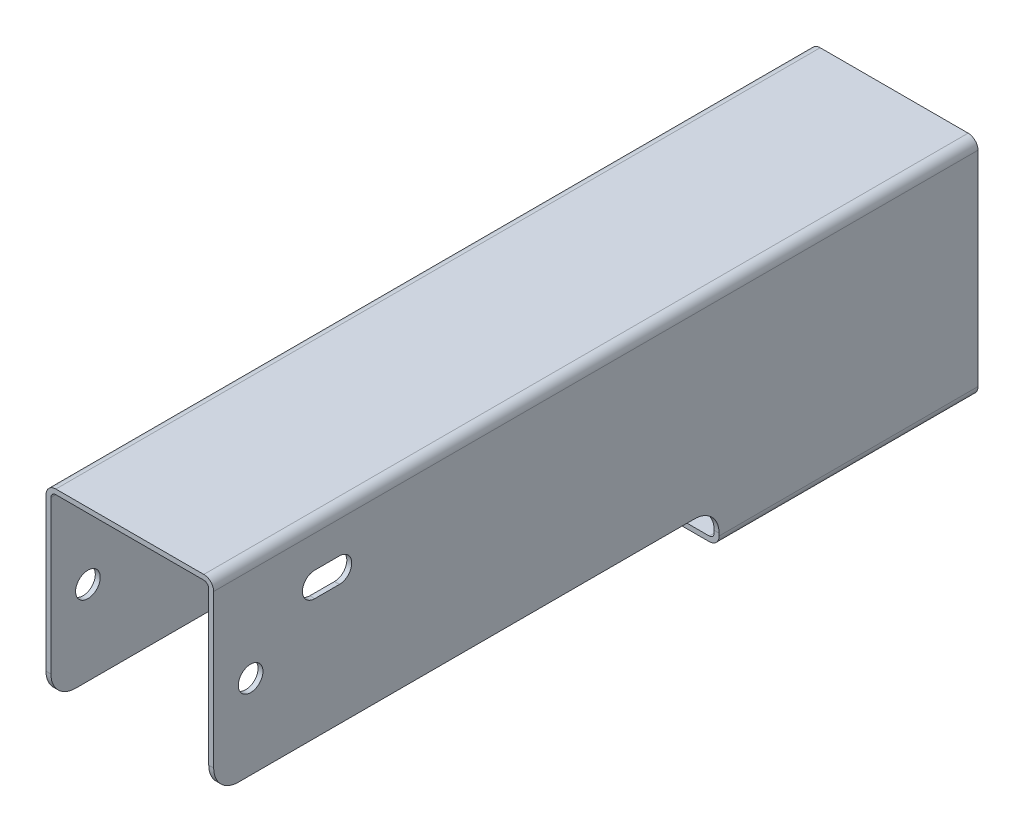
from build123d import *

# Parameters (mm, degrees)
ESQUISSE1_W             = 64
ESQUISSE1_H             = 2
EXTRUSION1_DEPTH        = 310
ESQUISSE2_W             = 2
ESQUISSE2_H             = 310
EXTRUSION2_DEPTH        = 76
CONG_1_R                = 2
CONG_2_R                = 4
CONG_3_R                = 10
EXTRUSION3_DEPTH        = 105
CONG_4_R                = 2
CONG_5_R                = 4
CONG_6_R                = 10
ESQUISSE7_R             = 5
ENL_V_MAT_EXTRU_4_DEPTH = 100


with BuildPart() as part:
    # Esquisse1 → Extrusion1 (new body)
    with BuildSketch(Plane.XY):
        with Locations((0, 1)):
            Rectangle(ESQUISSE1_W, ESQUISSE1_H)
    extrude(amount=-EXTRUSION1_DEPTH)

    # Esquisse2 → Extrusion2 (add)
    with BuildSketch(Plane(origin=(0, 2, 0), x_dir=(-1, 0, 0), z_dir=(0, 1, 0))):
        with Locations((-33, -155)):
            Rectangle(ESQUISSE2_W, ESQUISSE2_H)
        with Locations((33, -155)):
            Rectangle(ESQUISSE2_W, ESQUISSE2_H)
    extrude(amount=-EXTRUSION2_DEPTH)

    # Cong_1
    cong_1_edges = [part.edges().sort_by_distance(p)[0] for p in [
        (32, 0, -155),
        (-32, 0, -155),
    ]]
    fillet(cong_1_edges, radius=CONG_1_R)

    # Cong_2
    cong_2_edges = [part.edges().sort_by_distance(p)[0] for p in [
        (34, 2, -155),
        (-34, 2, -155),
    ]]
    fillet(cong_2_edges, radius=CONG_2_R)

    # Cong_3
    cong_3_edges = [part.edges().sort_by_distance(p)[0] for p in [
        (-33, -74, 0),
        (33, -74, 0),
    ]]
    fillet(cong_3_edges, radius=CONG_3_R)

    # Esquisse5 → Extrusion3 (add)
    with BuildSketch(Plane(origin=(0, 0, -310), x_dir=(-1, 0, 0), z_dir=(0, 0, -1))):
        Polygon((32, -74), (32, -87), (-32, -87), (-32, -74), (-34, -74), (-34, -89), (34, -89), (34, -74), align=None)
    extrude(amount=-EXTRUSION3_DEPTH)

    # Cong_4
    cong_4_edges = [part.edges().sort_by_distance(p)[0] for p in [
        (32, -87, -257.5),
        (-32, -87, -257.5),
    ]]
    fillet(cong_4_edges, radius=CONG_4_R)

    # Cong_5
    cong_5_edges = [part.edges().sort_by_distance(p)[0] for p in [
        (-34, -89, -257.5),
        (34, -89, -257.5),
    ]]
    fillet(cong_5_edges, radius=CONG_5_R)

    # Cong_6
    cong_6_edges = [part.edges().sort_by_distance(p)[0] for p in [
        (-33, -74, -205),
        (33, -74, -205),
    ]]
    fillet(cong_6_edges, radius=CONG_6_R)

    # Esquisse7 → Enl_v. mat.-Extru.4 (cut)
    with BuildSketch(Plane(origin=(34, 0, 0), x_dir=(0, 0, -1), z_dir=(1, 0, 0))):
        with Locations((15, -40)):
            Circle(ESQUISSE7_R)
        with BuildLine():
            Line((51, -15), (41, -15))
            ThreePointArc((41, -15), (36, -20), (41, -25))
            Line((41, -25), (51, -25))
            ThreePointArc((51, -25), (56, -20), (51, -15))
        make_face()
    extrude(amount=-ENL_V_MAT_EXTRU_4_DEPTH, mode=Mode.SUBTRACT)


solid = part.part
